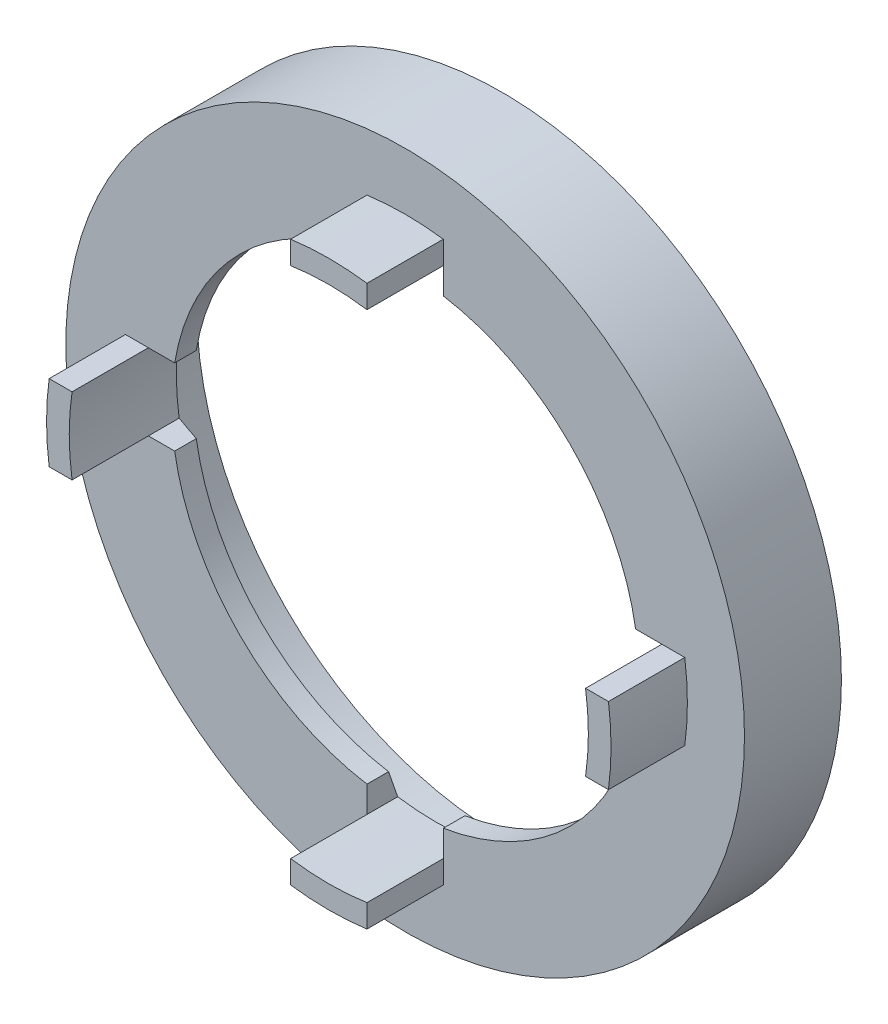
ISO-10303-21;
HEADER;
FILE_DESCRIPTION(('STEP AP214'),'2;1');
FILE_NAME('part.step','',(''),(''),'','','');
FILE_SCHEMA(('AUTOMOTIVE_DESIGN { 1 0 10303 214 1 1 1 1 }'));
ENDSEC;
DATA;
#1=APPLICATION_CONTEXT('core data for automotive mechanical design processes');
#2=APPLICATION_PROTOCOL_DEFINITION('international standard','automotive_design',2000,#1);
#3=PRODUCT_CONTEXT('',#1,'mechanical');
#4=PRODUCT('Part','Part','',(#3));
#5=PRODUCT_RELATED_PRODUCT_CATEGORY('part','',(#4));
#6=PRODUCT_DEFINITION_FORMATION('','',#4);
#7=PRODUCT_DEFINITION_CONTEXT('part definition',#1,'design');
#8=PRODUCT_DEFINITION('design','',#6,#7);
#9=PRODUCT_DEFINITION_SHAPE('','',#8);
#10=(LENGTH_UNIT() NAMED_UNIT(*) SI_UNIT(.MILLI.,.METRE.));
#11=(NAMED_UNIT(*) PLANE_ANGLE_UNIT() SI_UNIT($,.RADIAN.));
#12=(NAMED_UNIT(*) SI_UNIT($,.STERADIAN.) SOLID_ANGLE_UNIT());
#13=UNCERTAINTY_MEASURE_WITH_UNIT(LENGTH_MEASURE(1.E-05),#10,'distance_accuracy_value','');
#14=(GEOMETRIC_REPRESENTATION_CONTEXT(3) GLOBAL_UNCERTAINTY_ASSIGNED_CONTEXT((#13)) GLOBAL_UNIT_ASSIGNED_CONTEXT((#10,
#11,#12)) REPRESENTATION_CONTEXT('',''));
#15=CARTESIAN_POINT('',(0.,0.,0.));
#16=DIRECTION('',(0.,0.,1.));
#17=DIRECTION('',(1.,0.,0.));
#18=AXIS2_PLACEMENT_3D('',#15,#16,#17);
#19=CARTESIAN_POINT('',(0.,0.,-0.00100000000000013));
#20=DIRECTION('',(0.,0.,1.));
#21=DIRECTION('',(1.,0.,0.));
#22=AXIS2_PLACEMENT_3D('',#19,#20,#21);
#23=CYLINDRICAL_SURFACE('',#22,15.3);
#24=CARTESIAN_POINT('',(0.,0.,6.35));
#25=DIRECTION('',(0.,0.,1.));
#26=DIRECTION('',(1.,0.,0.));
#27=AXIS2_PLACEMENT_3D('',#24,#25,#26);
#28=CIRCLE('',#27,15.3);
#29=CARTESIAN_POINT('',(-15.0943698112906,-2.5,6.35));
#30=VERTEX_POINT('',#29);
#31=CARTESIAN_POINT('',(-2.50000000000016,-15.0943698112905,6.35));
#32=VERTEX_POINT('',#31);
#33=EDGE_CURVE('E458',#30,#32,#28,.T.);
#34=ORIENTED_EDGE('',*,*,#33,.T.);
#35=DIRECTION('',(0.,0.,1.));
#36=VECTOR('',#35,1.);
#37=CARTESIAN_POINT('',(-2.50000000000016,-15.0943698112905,0.));
#38=LINE('',#37,#36);
#39=CARTESIAN_POINT('',(-2.50000000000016,-15.0943698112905,4.93597347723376));
#40=VERTEX_POINT('',#39);
#41=EDGE_CURVE('E549',#40,#32,#38,.T.);
#42=ORIENTED_EDGE('',*,*,#41,.F.);
#43=CARTESIAN_POINT('',(0.,0.,4.93597347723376));
#44=DIRECTION('',(0.,0.,-1.));
#45=DIRECTION('',(-1.,0.,0.));
#46=AXIS2_PLACEMENT_3D('',#43,#44,#45);
#47=CIRCLE('',#46,15.3);
#48=CARTESIAN_POINT('',(-15.0943698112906,-2.5,4.93597347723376));
#49=VERTEX_POINT('',#48);
#50=EDGE_CURVE('E39',#49,#40,#47,.F.);
#51=ORIENTED_EDGE('',*,*,#50,.F.);
#52=DIRECTION('',(0.,0.,1.));
#53=VECTOR('',#52,1.);
#54=CARTESIAN_POINT('',(-15.0943698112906,-2.5,0.));
#55=LINE('',#54,#53);
#56=EDGE_CURVE('E337',#49,#30,#55,.T.);
#57=ORIENTED_EDGE('',*,*,#56,.T.);
#58=EDGE_LOOP('',(#34,#42,#51,#57));
#59=FACE_BOUND('',#58,.T.);
#60=ADVANCED_FACE('F35',(#59),#23,.F.);
#61=CARTESIAN_POINT('',(0.,0.,4.33860931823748));
#62=DIRECTION('',(0.,0.,-1.));
#63=DIRECTION('',(-1.,0.,0.));
#64=AXIS2_PLACEMENT_3D('',#61,#62,#63);
#65=CONICAL_SURFACE('',#64,17.,1.23288313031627);
#66=CARTESIAN_POINT('',(-2.50000000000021,-19.9102654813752,3.26103258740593));
#67=CARTESIAN_POINT('',(-2.5000000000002,-19.3470900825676,3.45738063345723));
#68=CARTESIAN_POINT('',(-2.50000000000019,-18.7838773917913,3.65362183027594));
#69=CARTESIAN_POINT('',(-2.50000000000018,-17.657347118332,4.04580190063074));
#70=CARTESIAN_POINT('',(-2.50000000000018,-17.0940295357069,4.24174077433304));
#71=CARTESIAN_POINT('',(-2.50000000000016,-15.9672583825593,4.63322784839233));
#72=CARTESIAN_POINT('',(-2.50000000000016,-15.4038048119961,4.82877604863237));
#73=CARTESIAN_POINT('',(-2.50000000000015,-14.276705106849,5.21931764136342));
#74=CARTESIAN_POINT('',(-2.50000000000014,-13.7130589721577,5.41431103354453));
#75=CARTESIAN_POINT('',(-2.50000000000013,-13.1492884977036,5.60894487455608));
#76=B_SPLINE_CURVE_WITH_KNOTS('',3,(#66,#67,#68,#69,#70,#71,#72,#73,#74,#75),.UNSPECIFIED.,.F.,
.F.,(4,2,2,2,4),(0.,1.78926574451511,3.57853050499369,5.36779580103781,7.15706209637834),.UNSPECIFIED.);
#77=CARTESIAN_POINT('',(-2.50000000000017,-16.8151717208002,4.33860931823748));
#78=VERTEX_POINT('',#77);
#79=EDGE_CURVE('E485',#78,#40,#76,.T.);
#80=ORIENTED_EDGE('',*,*,#79,.F.);
#81=CARTESIAN_POINT('',(0.,0.,4.33860931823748));
#82=DIRECTION('',(0.,0.,1.));
#83=DIRECTION('',(1.,0.,0.));
#84=AXIS2_PLACEMENT_3D('',#81,#82,#83);
#85=CIRCLE('',#84,17.);
#86=CARTESIAN_POINT('',(-16.8151717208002,-2.5,4.33860931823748));
#87=VERTEX_POINT('',#86);
#88=EDGE_CURVE('E607',#87,#78,#85,.T.);
#89=ORIENTED_EDGE('',*,*,#88,.F.);
#90=CARTESIAN_POINT('',(-13.1492884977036,-2.5,5.60894487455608));
#91=CARTESIAN_POINT('',(-13.7130589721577,-2.5,5.41431103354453));
#92=CARTESIAN_POINT('',(-14.276705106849,-2.5,5.21931764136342));
#93=CARTESIAN_POINT('',(-15.4038048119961,-2.5,4.82877604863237));
#94=CARTESIAN_POINT('',(-15.9672583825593,-2.5,4.63322784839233));
#95=CARTESIAN_POINT('',(-17.0940295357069,-2.5,4.24174077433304));
#96=CARTESIAN_POINT('',(-17.657347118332,-2.5,4.04580190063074));
#97=CARTESIAN_POINT('',(-18.7838773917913,-2.5,3.65362183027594));
#98=CARTESIAN_POINT('',(-19.3470900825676,-2.5,3.45738063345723));
#99=CARTESIAN_POINT('',(-19.9102654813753,-2.5,3.26103258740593));
#100=B_SPLINE_CURVE_WITH_KNOTS('',3,(#90,#91,#92,#93,#94,#95,#96,#97,#98,#99),.UNSPECIFIED.,.F.,
.F.,(4,2,2,2,4),(0.,1.78926629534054,3.57853159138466,5.36779635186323,7.15706209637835),.UNSPECIFIED.);
#101=EDGE_CURVE('E333',#49,#87,#100,.T.);
#102=ORIENTED_EDGE('',*,*,#101,.F.);
#103=ORIENTED_EDGE('',*,*,#50,.T.);
#104=EDGE_LOOP('',(#80,#89,#102,#103));
#105=FACE_BOUND('',#104,.T.);
#106=ADVANCED_FACE('F396',(#105),#65,.F.);
#107=CARTESIAN_POINT('',(2.49999999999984,-15.0943698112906,4.93597347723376));
#108=VERTEX_POINT('',#107);
#109=CARTESIAN_POINT('',(15.0943698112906,-2.5,4.93597347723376));
#110=VERTEX_POINT('',#109);
#111=EDGE_CURVE('E441',#108,#110,#47,.F.);
#112=ORIENTED_EDGE('',*,*,#111,.F.);
#113=DIRECTION('',(0.,0.,1.));
#114=VECTOR('',#113,1.);
#115=CARTESIAN_POINT('',(2.49999999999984,-15.0943698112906,0.));
#116=LINE('',#115,#114);
#117=CARTESIAN_POINT('',(2.49999999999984,-15.0943698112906,6.35));
#118=VERTEX_POINT('',#117);
#119=EDGE_CURVE('E235',#108,#118,#116,.T.);
#120=ORIENTED_EDGE('',*,*,#119,.T.);
#121=CARTESIAN_POINT('',(15.0943698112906,-2.5,6.35));
#122=VERTEX_POINT('',#121);
#123=EDGE_CURVE('E247',#118,#122,#28,.T.);
#124=ORIENTED_EDGE('',*,*,#123,.T.);
#125=DIRECTION('',(0.,0.,1.));
#126=VECTOR('',#125,1.);
#127=CARTESIAN_POINT('',(15.0943698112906,-2.5,0.));
#128=LINE('',#127,#126);
#129=EDGE_CURVE('E468',#110,#122,#128,.T.);
#130=ORIENTED_EDGE('',*,*,#129,.F.);
#131=EDGE_LOOP('',(#112,#120,#124,#130));
#132=FACE_BOUND('',#131,.T.);
#133=ADVANCED_FACE('F399',(#132),#23,.F.);
#134=CARTESIAN_POINT('',(2.49999999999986,-13.1492884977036,5.60894487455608));
#135=CARTESIAN_POINT('',(2.49999999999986,-13.7130589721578,5.41431103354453));
#136=CARTESIAN_POINT('',(2.49999999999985,-14.276705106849,5.21931764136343));
#137=CARTESIAN_POINT('',(2.49999999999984,-15.4038048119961,4.82877604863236));
#138=CARTESIAN_POINT('',(2.49999999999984,-15.9672583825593,4.63322784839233));
#139=CARTESIAN_POINT('',(2.49999999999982,-17.094029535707,4.24174077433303));
#140=CARTESIAN_POINT('',(2.49999999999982,-17.6573471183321,4.04580190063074));
#141=CARTESIAN_POINT('',(2.49999999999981,-18.7838773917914,3.65362183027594));
#142=CARTESIAN_POINT('',(2.4999999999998,-19.3470900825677,3.45738063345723));
#143=CARTESIAN_POINT('',(2.49999999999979,-19.9102654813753,3.26103258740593));
#144=B_SPLINE_CURVE_WITH_KNOTS('',3,(#134,#135,#136,#137,#138,#139,#140,#141,#142,#143),
.UNSPECIFIED.,.F.,.F.,(4,2,2,2,4),(0.,1.78926629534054,3.57853159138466,5.36779635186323,
7.15706209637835),.UNSPECIFIED.);
#145=CARTESIAN_POINT('',(2.49999999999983,-16.8151717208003,4.33860931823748));
#146=VERTEX_POINT('',#145);
#147=EDGE_CURVE('E231',#108,#146,#144,.T.);
#148=ORIENTED_EDGE('',*,*,#147,.F.);
#149=ORIENTED_EDGE('',*,*,#111,.T.);
#150=CARTESIAN_POINT('',(18.758943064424,-2.5,3.66225355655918));
#151=CARTESIAN_POINT('',(18.1957071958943,-2.5,3.85842851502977));
#152=CARTESIAN_POINT('',(17.632427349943,-2.5,4.05447738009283));
#153=CARTESIAN_POINT('',(16.505740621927,-2.5,4.44620814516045));
#154=CARTESIAN_POINT('',(15.9423337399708,-2.5,4.6418900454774));
#155=CARTESIAN_POINT('',(14.8153526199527,-2.5,5.03277253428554));
#156=CARTESIAN_POINT('',(14.2517783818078,-2.5,5.22797312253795));
#157=CARTESIAN_POINT('',(13.124386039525,-2.5,5.61767023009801));
#158=CARTESIAN_POINT('',(12.5605679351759,-2.5,5.81216674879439));
#159=CARTESIAN_POINT('',(11.9965899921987,-2.5,6.00619973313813));
#160=B_SPLINE_CURVE_WITH_KNOTS('',3,(#150,#151,#152,#153,#154,#155,#156,#157,#158,#159),
.UNSPECIFIED.,.F.,.F.,(4,2,2,2,4),(0.,1.7892661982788,3.57853087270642,5.36779643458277,
7.15706354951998),.UNSPECIFIED.);
#161=CARTESIAN_POINT('',(16.8151717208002,-2.5,4.33860931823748));
#162=VERTEX_POINT('',#161);
#163=EDGE_CURVE('E476',#162,#110,#160,.T.);
#164=ORIENTED_EDGE('',*,*,#163,.F.);
#165=EDGE_CURVE('E608',#146,#162,#85,.T.);
#166=ORIENTED_EDGE('',*,*,#165,.F.);
#167=EDGE_LOOP('',(#148,#149,#164,#166));
#168=FACE_BOUND('',#167,.T.);
#169=ADVANCED_FACE('F405',(#168),#65,.F.);
#170=CARTESIAN_POINT('',(15.0943698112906,2.5,4.93597347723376));
#171=VERTEX_POINT('',#170);
#172=CARTESIAN_POINT('',(2.50000000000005,15.0943698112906,4.93597347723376));
#173=VERTEX_POINT('',#172);
#174=EDGE_CURVE('E433',#171,#173,#47,.F.);
#175=ORIENTED_EDGE('',*,*,#174,.F.);
#176=DIRECTION('',(0.,0.,1.));
#177=VECTOR('',#176,1.);
#178=CARTESIAN_POINT('',(15.0943698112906,2.5,0.));
#179=LINE('',#178,#177);
#180=CARTESIAN_POINT('',(15.0943698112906,2.5,6.35));
#181=VERTEX_POINT('',#180);
#182=EDGE_CURVE('E434',#171,#181,#179,.T.);
#183=ORIENTED_EDGE('',*,*,#182,.T.);
#184=CARTESIAN_POINT('',(2.50000000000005,15.0943698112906,6.35));
#185=VERTEX_POINT('',#184);
#186=EDGE_CURVE('E456',#181,#185,#28,.T.);
#187=ORIENTED_EDGE('',*,*,#186,.T.);
#188=DIRECTION('',(0.,0.,1.));
#189=VECTOR('',#188,1.);
#190=CARTESIAN_POINT('',(2.50000000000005,15.0943698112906,0.));
#191=LINE('',#190,#189);
#192=EDGE_CURVE('E437',#173,#185,#191,.T.);
#193=ORIENTED_EDGE('',*,*,#192,.F.);
#194=EDGE_LOOP('',(#175,#183,#187,#193));
#195=FACE_BOUND('',#194,.T.);
#196=ADVANCED_FACE('F410',(#195),#23,.F.);
#197=CARTESIAN_POINT('',(11.9965899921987,2.5,6.00619973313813));
#198=CARTESIAN_POINT('',(12.5605679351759,2.5,5.81216674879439));
#199=CARTESIAN_POINT('',(13.124386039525,2.5,5.61767023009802));
#200=CARTESIAN_POINT('',(14.2517783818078,2.5,5.22797312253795));
#201=CARTESIAN_POINT('',(14.8153526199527,2.5,5.03277253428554));
#202=CARTESIAN_POINT('',(15.9423337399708,2.5,4.6418900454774));
#203=CARTESIAN_POINT('',(16.505740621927,2.5,4.44620814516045));
#204=CARTESIAN_POINT('',(17.632427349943,2.5,4.05447738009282));
#205=CARTESIAN_POINT('',(18.1957071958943,2.5,3.85842851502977));
#206=CARTESIAN_POINT('',(18.758943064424,2.5,3.66225355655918));
#207=B_SPLINE_CURVE_WITH_KNOTS('',3,(#197,#198,#199,#200,#201,#202,#203,#204,#205,#206),
.UNSPECIFIED.,.F.,.F.,(4,2,2,2,4),(0.,1.78926711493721,3.57853267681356,5.36779735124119,
7.15706354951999),.UNSPECIFIED.);
#208=CARTESIAN_POINT('',(16.8151717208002,2.5,4.33860931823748));
#209=VERTEX_POINT('',#208);
#210=EDGE_CURVE('E489',#171,#209,#207,.T.);
#211=ORIENTED_EDGE('',*,*,#210,.F.);
#212=ORIENTED_EDGE('',*,*,#174,.T.);
#213=CARTESIAN_POINT('',(2.50000000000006,18.758943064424,3.66225355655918));
#214=CARTESIAN_POINT('',(2.50000000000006,18.1957071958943,3.85842851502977));
#215=CARTESIAN_POINT('',(2.50000000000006,17.632427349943,4.05447738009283));
#216=CARTESIAN_POINT('',(2.50000000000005,16.505740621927,4.44620814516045));
#217=CARTESIAN_POINT('',(2.50000000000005,15.9423337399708,4.6418900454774));
#218=CARTESIAN_POINT('',(2.50000000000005,14.8153526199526,5.03277253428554));
#219=CARTESIAN_POINT('',(2.50000000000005,14.2517783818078,5.22797312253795));
#220=CARTESIAN_POINT('',(2.50000000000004,13.124386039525,5.61767023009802));
#221=CARTESIAN_POINT('',(2.50000000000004,12.5605679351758,5.81216674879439));
#222=CARTESIAN_POINT('',(2.50000000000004,11.9965899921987,6.00619973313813));
#223=B_SPLINE_CURVE_WITH_KNOTS('',3,(#213,#214,#215,#216,#217,#218,#219,#220,#221,#222),
.UNSPECIFIED.,.F.,.F.,(4,2,2,2,4),(0.,1.7892661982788,3.57853087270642,5.36779643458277,
7.15706354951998),.UNSPECIFIED.);
#224=CARTESIAN_POINT('',(2.50000000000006,16.8151717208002,4.33860931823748));
#225=VERTEX_POINT('',#224);
#226=EDGE_CURVE('E520',#225,#173,#223,.T.);
#227=ORIENTED_EDGE('',*,*,#226,.F.);
#228=EDGE_CURVE('E613',#209,#225,#85,.T.);
#229=ORIENTED_EDGE('',*,*,#228,.F.);
#230=EDGE_LOOP('',(#211,#212,#227,#229));
#231=FACE_BOUND('',#230,.T.);
#232=ADVANCED_FACE('F422',(#231),#65,.F.);
#233=CARTESIAN_POINT('',(0.,0.,6.35));
#234=DIRECTION('',(0.,0.,1.));
#235=DIRECTION('',(1.,0.,0.));
#236=AXIS2_PLACEMENT_3D('',#233,#234,#235);
#237=PLANE('',#236);
#238=DIRECTION('',(0.,-1.,0.));
#239=VECTOR('',#238,1.);
#240=CARTESIAN_POINT('',(-2.50000000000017,-16.8151717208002,6.35));
#241=LINE('',#240,#239);
#242=CARTESIAN_POINT('',(-2.50000000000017,-16.8151717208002,6.35));
#243=VERTEX_POINT('',#242);
#244=EDGE_CURVE('E236',#32,#243,#241,.T.);
#245=ORIENTED_EDGE('',*,*,#244,.F.);
#246=ORIENTED_EDGE('',*,*,#33,.F.);
#247=DIRECTION('',(1.,0.,0.));
#248=VECTOR('',#247,1.);
#249=CARTESIAN_POINT('',(-16.8151717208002,-2.5,6.35));
#250=LINE('',#249,#248);
#251=CARTESIAN_POINT('',(-16.8151717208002,-2.5,6.35));
#252=VERTEX_POINT('',#251);
#253=EDGE_CURVE('E325',#252,#30,#250,.T.);
#254=ORIENTED_EDGE('',*,*,#253,.F.);
#255=DIRECTION('',(1.,0.,0.));
#256=VECTOR('',#255,1.);
#257=CARTESIAN_POINT('',(-18.3151717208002,-2.5,6.35));
#258=LINE('',#257,#256);
#259=CARTESIAN_POINT('',(-18.3151717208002,-2.5,6.35));
#260=VERTEX_POINT('',#259);
#261=EDGE_CURVE('E574',#260,#252,#258,.T.);
#262=ORIENTED_EDGE('',*,*,#261,.F.);
#263=CARTESIAN_POINT('',(0.,0.,6.35));
#264=DIRECTION('',(0.,0.,1.));
#265=DIRECTION('',(1.,0.,0.));
#266=AXIS2_PLACEMENT_3D('',#263,#264,#265);
#267=CIRCLE('',#266,18.4850078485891);
#268=CARTESIAN_POINT('',(-18.3151717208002,2.5,6.35));
#269=VERTEX_POINT('',#268);
#270=EDGE_CURVE('E584',#269,#260,#267,.T.);
#271=ORIENTED_EDGE('',*,*,#270,.F.);
#272=DIRECTION('',(-1.,0.,0.));
#273=VECTOR('',#272,1.);
#274=CARTESIAN_POINT('',(-16.8151717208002,2.5,6.35));
#275=LINE('',#274,#273);
#276=CARTESIAN_POINT('',(-16.8151717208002,2.5,6.35));
#277=VERTEX_POINT('',#276);
#278=EDGE_CURVE('E648',#277,#269,#275,.T.);
#279=ORIENTED_EDGE('',*,*,#278,.F.);
#280=DIRECTION('',(-1.,0.,0.));
#281=VECTOR('',#280,1.);
#282=CARTESIAN_POINT('',(-16.8151717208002,2.5,6.35));
#283=LINE('',#282,#281);
#284=CARTESIAN_POINT('',(-15.0943698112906,2.5,6.35));
#285=VERTEX_POINT('',#284);
#286=EDGE_CURVE('E327',#285,#277,#283,.T.);
#287=ORIENTED_EDGE('',*,*,#286,.F.);
#288=CARTESIAN_POINT('',(-2.49999999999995,15.0943698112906,6.35));
#289=VERTEX_POINT('',#288);
#290=EDGE_CURVE('E452',#289,#285,#28,.T.);
#291=ORIENTED_EDGE('',*,*,#290,.F.);
#292=DIRECTION('',(0.,-1.,0.));
#293=VECTOR('',#292,1.);
#294=CARTESIAN_POINT('',(-2.49999999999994,16.8151717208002,6.35));
#295=LINE('',#294,#293);
#296=CARTESIAN_POINT('',(-2.49999999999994,16.8151717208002,6.35));
#297=VERTEX_POINT('',#296);
#298=EDGE_CURVE('E644',#297,#289,#295,.T.);
#299=ORIENTED_EDGE('',*,*,#298,.F.);
#300=DIRECTION('',(0.,-1.,0.));
#301=VECTOR('',#300,1.);
#302=CARTESIAN_POINT('',(-2.49999999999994,18.3151717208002,6.35));
#303=LINE('',#302,#301);
#304=CARTESIAN_POINT('',(-2.49999999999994,18.3151717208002,6.35));
#305=VERTEX_POINT('',#304);
#306=EDGE_CURVE('E302',#305,#297,#303,.T.);
#307=ORIENTED_EDGE('',*,*,#306,.F.);
#308=CARTESIAN_POINT('',(0.,0.,6.35));
#309=DIRECTION('',(0.,0.,1.));
#310=DIRECTION('',(0.,-1.,0.));
#311=AXIS2_PLACEMENT_3D('',#308,#309,#310);
#312=CIRCLE('',#311,18.4850078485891);
#313=CARTESIAN_POINT('',(2.50000000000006,18.3151717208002,6.35));
#314=VERTEX_POINT('',#313);
#315=EDGE_CURVE('E310',#314,#305,#312,.T.);
#316=ORIENTED_EDGE('',*,*,#315,.F.);
#317=DIRECTION('',(0.,1.,0.));
#318=VECTOR('',#317,1.);
#319=CARTESIAN_POINT('',(2.50000000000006,16.8151717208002,6.35));
#320=LINE('',#319,#318);
#321=CARTESIAN_POINT('',(2.50000000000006,16.8151717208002,6.35));
#322=VERTEX_POINT('',#321);
#323=EDGE_CURVE('E297',#322,#314,#320,.T.);
#324=ORIENTED_EDGE('',*,*,#323,.F.);
#325=DIRECTION('',(0.,1.,0.));
#326=VECTOR('',#325,1.);
#327=CARTESIAN_POINT('',(2.50000000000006,16.8151717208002,6.35));
#328=LINE('',#327,#326);
#329=EDGE_CURVE('E626',#185,#322,#328,.T.);
#330=ORIENTED_EDGE('',*,*,#329,.F.);
#331=ORIENTED_EDGE('',*,*,#186,.F.);
#332=DIRECTION('',(-1.,0.,0.));
#333=VECTOR('',#332,1.);
#334=CARTESIAN_POINT('',(16.8151717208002,2.5,6.35));
#335=LINE('',#334,#333);
#336=CARTESIAN_POINT('',(16.8151717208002,2.5,6.35));
#337=VERTEX_POINT('',#336);
#338=EDGE_CURVE('E482',#337,#181,#335,.T.);
#339=ORIENTED_EDGE('',*,*,#338,.F.);
#340=DIRECTION('',(-1.,0.,0.));
#341=VECTOR('',#340,1.);
#342=CARTESIAN_POINT('',(18.3151717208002,2.5,6.35));
#343=LINE('',#342,#341);
#344=CARTESIAN_POINT('',(18.3151717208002,2.5,6.35));
#345=VERTEX_POINT('',#344);
#346=EDGE_CURVE('E277',#345,#337,#343,.T.);
#347=ORIENTED_EDGE('',*,*,#346,.F.);
#348=CARTESIAN_POINT('',(0.,0.,6.35));
#349=DIRECTION('',(0.,0.,1.));
#350=DIRECTION('',(-1.,0.,0.));
#351=AXIS2_PLACEMENT_3D('',#348,#349,#350);
#352=CIRCLE('',#351,18.4850078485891);
#353=CARTESIAN_POINT('',(18.3151717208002,-2.5,6.35));
#354=VERTEX_POINT('',#353);
#355=EDGE_CURVE('E285',#354,#345,#352,.T.);
#356=ORIENTED_EDGE('',*,*,#355,.F.);
#357=DIRECTION('',(1.,0.,0.));
#358=VECTOR('',#357,1.);
#359=CARTESIAN_POINT('',(16.8151717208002,-2.5,6.35));
#360=LINE('',#359,#358);
#361=CARTESIAN_POINT('',(16.8151717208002,-2.5,6.35));
#362=VERTEX_POINT('',#361);
#363=EDGE_CURVE('E272',#362,#354,#360,.T.);
#364=ORIENTED_EDGE('',*,*,#363,.F.);
#365=DIRECTION('',(1.,0.,0.));
#366=VECTOR('',#365,1.);
#367=CARTESIAN_POINT('',(16.8151717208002,-2.5,6.35));
#368=LINE('',#367,#366);
#369=EDGE_CURVE('E473',#122,#362,#368,.T.);
#370=ORIENTED_EDGE('',*,*,#369,.F.);
#371=ORIENTED_EDGE('',*,*,#123,.F.);
#372=DIRECTION('',(0.,1.,0.));
#373=VECTOR('',#372,1.);
#374=CARTESIAN_POINT('',(2.49999999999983,-16.8151717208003,6.35));
#375=LINE('',#374,#373);
#376=CARTESIAN_POINT('',(2.49999999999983,-16.8151717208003,6.35));
#377=VERTEX_POINT('',#376);
#378=EDGE_CURVE('E228',#377,#118,#375,.T.);
#379=ORIENTED_EDGE('',*,*,#378,.F.);
#380=DIRECTION('',(0.,1.,0.));
#381=VECTOR('',#380,1.);
#382=CARTESIAN_POINT('',(2.49999999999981,-18.3151717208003,6.35));
#383=LINE('',#382,#381);
#384=CARTESIAN_POINT('',(2.49999999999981,-18.3151717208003,6.35));
#385=VERTEX_POINT('',#384);
#386=EDGE_CURVE('E245',#385,#377,#383,.T.);
#387=ORIENTED_EDGE('',*,*,#386,.F.);
#388=CARTESIAN_POINT('',(0.,0.,6.35));
#389=DIRECTION('',(0.,0.,1.));
#390=DIRECTION('',(0.,1.,0.));
#391=AXIS2_PLACEMENT_3D('',#388,#389,#390);
#392=CIRCLE('',#391,18.4850078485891);
#393=CARTESIAN_POINT('',(-2.50000000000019,-18.3151717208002,6.35));
#394=VERTEX_POINT('',#393);
#395=EDGE_CURVE('E254',#394,#385,#392,.T.);
#396=ORIENTED_EDGE('',*,*,#395,.F.);
#397=DIRECTION('',(0.,-1.,0.));
#398=VECTOR('',#397,1.);
#399=CARTESIAN_POINT('',(-2.50000000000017,-16.8151717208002,6.35));
#400=LINE('',#399,#398);
#401=EDGE_CURVE('E526',#243,#394,#400,.T.);
#402=ORIENTED_EDGE('',*,*,#401,.F.);
#403=EDGE_LOOP('',(#245,#246,#254,#262,#271,#279,#287,#291,#299,#307,#316,#324,#330,#331,#339,
#347,#356,#364,#370,#371,#379,#387,#396,#402));
#404=FACE_BOUND('',#403,.T.);
#405=CARTESIAN_POINT('',(0.,0.,6.35));
#406=DIRECTION('',(0.,0.,1.));
#407=DIRECTION('',(1.,0.,0.));
#408=AXIS2_PLACEMENT_3D('',#405,#406,#407);
#409=CIRCLE('',#408,22.225);
#410=CARTESIAN_POINT('',(22.225,0.,6.35));
#411=VERTEX_POINT('',#410);
#412=EDGE_CURVE('E11',#411,#411,#409,.T.);
#413=ORIENTED_EDGE('',*,*,#412,.T.);
#414=EDGE_LOOP('',(#413));
#415=FACE_BOUND('',#414,.T.);
#416=ADVANCED_FACE('F242',(#404,#415),#237,.T.);
#417=CARTESIAN_POINT('',(0.,0.,0.));
#418=DIRECTION('',(0.,0.,1.));
#419=DIRECTION('',(1.,0.,0.));
#420=AXIS2_PLACEMENT_3D('',#417,#418,#419);
#421=PLANE('',#420);
#422=CARTESIAN_POINT('',(0.,0.,0.));
#423=DIRECTION('',(0.,0.,1.));
#424=DIRECTION('',(1.,0.,0.));
#425=AXIS2_PLACEMENT_3D('',#422,#423,#424);
#426=CIRCLE('',#425,22.225);
#427=CARTESIAN_POINT('',(22.225,0.,0.));
#428=VERTEX_POINT('',#427);
#429=EDGE_CURVE('E44',#428,#428,#426,.T.);
#430=ORIENTED_EDGE('',*,*,#429,.F.);
#431=EDGE_LOOP('',(#430));
#432=FACE_BOUND('',#431,.T.);
#433=CARTESIAN_POINT('',(0.,0.,0.));
#434=DIRECTION('',(0.,0.,1.));
#435=DIRECTION('',(1.,0.,0.));
#436=AXIS2_PLACEMENT_3D('',#433,#434,#435);
#437=CIRCLE('',#436,20.);
#438=CARTESIAN_POINT('',(20.,0.,0.));
#439=VERTEX_POINT('',#438);
#440=EDGE_CURVE('E443',#439,#439,#437,.T.);
#441=ORIENTED_EDGE('',*,*,#440,.T.);
#442=EDGE_LOOP('',(#441));
#443=FACE_BOUND('',#442,.T.);
#444=ADVANCED_FACE('F412',(#432,#443),#421,.F.);
#445=CARTESIAN_POINT('',(-2.49999999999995,15.0943698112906,4.93597347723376));
#446=VERTEX_POINT('',#445);
#447=CARTESIAN_POINT('',(-15.0943698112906,2.5,4.93597347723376));
#448=VERTEX_POINT('',#447);
#449=EDGE_CURVE('E442',#446,#448,#47,.F.);
#450=ORIENTED_EDGE('',*,*,#449,.F.);
#451=DIRECTION('',(0.,0.,1.));
#452=VECTOR('',#451,1.);
#453=CARTESIAN_POINT('',(-2.49999999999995,15.0943698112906,0.));
#454=LINE('',#453,#452);
#455=EDGE_CURVE('E638',#446,#289,#454,.T.);
#456=ORIENTED_EDGE('',*,*,#455,.T.);
#457=ORIENTED_EDGE('',*,*,#290,.T.);
#458=DIRECTION('',(0.,0.,1.));
#459=VECTOR('',#458,1.);
#460=CARTESIAN_POINT('',(-15.0943698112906,2.5,0.));
#461=LINE('',#460,#459);
#462=EDGE_CURVE('E334',#448,#285,#461,.T.);
#463=ORIENTED_EDGE('',*,*,#462,.F.);
#464=EDGE_LOOP('',(#450,#456,#457,#463));
#465=FACE_BOUND('',#464,.T.);
#466=ADVANCED_FACE('F400',(#465),#23,.F.);
#467=CARTESIAN_POINT('',(0.,0.,6.35));
#468=DIRECTION('',(0.,0.,-1.));
#469=DIRECTION('',(-1.,0.,0.));
#470=AXIS2_PLACEMENT_3D('',#467,#468,#469);
#471=CYLINDRICAL_SURFACE('',#470,22.225);
#472=ORIENTED_EDGE('',*,*,#412,.F.);
#473=EDGE_LOOP('',(#472));
#474=FACE_BOUND('',#473,.T.);
#475=ORIENTED_EDGE('',*,*,#429,.T.);
#476=EDGE_LOOP('',(#475));
#477=FACE_BOUND('',#476,.T.);
#478=ADVANCED_FACE('F37',(#474,#477),#471,.T.);
#479=CARTESIAN_POINT('',(-2.49999999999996,11.9965899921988,6.00619973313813));
#480=CARTESIAN_POINT('',(-2.49999999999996,12.5605679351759,5.81216674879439));
#481=CARTESIAN_POINT('',(-2.49999999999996,13.124386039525,5.61767023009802));
#482=CARTESIAN_POINT('',(-2.49999999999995,14.2517783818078,5.22797312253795));
#483=CARTESIAN_POINT('',(-2.49999999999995,14.8153526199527,5.03277253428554));
#484=CARTESIAN_POINT('',(-2.49999999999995,15.9423337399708,4.6418900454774));
#485=CARTESIAN_POINT('',(-2.49999999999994,16.505740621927,4.44620814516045));
#486=CARTESIAN_POINT('',(-2.49999999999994,17.632427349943,4.05447738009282));
#487=CARTESIAN_POINT('',(-2.49999999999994,18.1957071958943,3.85842851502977));
#488=CARTESIAN_POINT('',(-2.49999999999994,18.758943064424,3.66225355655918));
#489=B_SPLINE_CURVE_WITH_KNOTS('',3,(#479,#480,#481,#482,#483,#484,#485,#486,#487,#488),
.UNSPECIFIED.,.F.,.F.,(4,2,2,2,4),(0.,1.78926711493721,3.57853267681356,5.36779735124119,
7.15706354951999),.UNSPECIFIED.);
#490=CARTESIAN_POINT('',(-2.49999999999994,16.8151717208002,4.33860931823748));
#491=VERTEX_POINT('',#490);
#492=EDGE_CURVE('E527',#446,#491,#489,.T.);
#493=ORIENTED_EDGE('',*,*,#492,.F.);
#494=ORIENTED_EDGE('',*,*,#449,.T.);
#495=CARTESIAN_POINT('',(-19.9102654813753,2.5,3.26103258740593));
#496=CARTESIAN_POINT('',(-19.3470900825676,2.5,3.45738063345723));
#497=CARTESIAN_POINT('',(-18.7838773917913,2.5,3.65362183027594));
#498=CARTESIAN_POINT('',(-17.657347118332,2.5,4.04580190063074));
#499=CARTESIAN_POINT('',(-17.0940295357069,2.5,4.24174077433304));
#500=CARTESIAN_POINT('',(-15.9672583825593,2.5,4.63322784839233));
#501=CARTESIAN_POINT('',(-15.4038048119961,2.5,4.82877604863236));
#502=CARTESIAN_POINT('',(-14.276705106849,2.5,5.21931764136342));
#503=CARTESIAN_POINT('',(-13.7130589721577,2.5,5.41431103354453));
#504=CARTESIAN_POINT('',(-13.1492884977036,2.5,5.60894487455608));
#505=B_SPLINE_CURVE_WITH_KNOTS('',3,(#495,#496,#497,#498,#499,#500,#501,#502,#503,#504),
.UNSPECIFIED.,.F.,.F.,(4,2,2,2,4),(0.,1.78926574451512,3.57853050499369,5.36779580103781,
7.15706209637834),.UNSPECIFIED.);
#506=CARTESIAN_POINT('',(-16.8151717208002,2.5,4.33860931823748));
#507=VERTEX_POINT('',#506);
#508=EDGE_CURVE('E347',#507,#448,#505,.T.);
#509=ORIENTED_EDGE('',*,*,#508,.F.);
#510=EDGE_CURVE('E606',#491,#507,#85,.T.);
#511=ORIENTED_EDGE('',*,*,#510,.F.);
#512=EDGE_LOOP('',(#493,#494,#509,#511));
#513=FACE_BOUND('',#512,.T.);
#514=ADVANCED_FACE('F353',(#513),#65,.F.);
#515=CARTESIAN_POINT('',(0.,0.,-1.424421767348));
#516=DIRECTION('',(0.,0.,1.));
#517=DIRECTION('',(1.,0.,0.));
#518=AXIS2_PLACEMENT_3D('',#515,#516,#517);
#519=CYLINDRICAL_SURFACE('',#518,20.);
#520=CARTESIAN_POINT('',(0.,0.,4.33860931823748));
#521=DIRECTION('',(0.,0.,1.));
#522=DIRECTION('',(1.,0.,0.));
#523=AXIS2_PLACEMENT_3D('',#520,#521,#522);
#524=CIRCLE('',#523,20.);
#525=CARTESIAN_POINT('',(20.,0.,4.33860931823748));
#526=VERTEX_POINT('',#525);
#527=EDGE_CURVE('E603',#526,#526,#524,.T.);
#528=ORIENTED_EDGE('',*,*,#527,.T.);
#529=EDGE_LOOP('',(#528));
#530=FACE_BOUND('',#529,.T.);
#531=ORIENTED_EDGE('',*,*,#440,.F.);
#532=EDGE_LOOP('',(#531));
#533=FACE_BOUND('',#532,.T.);
#534=ADVANCED_FACE('F387',(#530,#533),#519,.F.);
#535=CARTESIAN_POINT('',(-17.,0.,4.33860931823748));
#536=DIRECTION('',(0.,0.,-1.));
#537=DIRECTION('',(-1.,0.,0.));
#538=AXIS2_PLACEMENT_3D('',#535,#536,#537);
#539=PLANE('',#538);
#540=EDGE_CURVE('E449',#507,#87,#85,.T.);
#541=ORIENTED_EDGE('',*,*,#540,.T.);
#542=ORIENTED_EDGE('',*,*,#88,.T.);
#543=EDGE_CURVE('E547',#78,#146,#85,.T.);
#544=ORIENTED_EDGE('',*,*,#543,.T.);
#545=ORIENTED_EDGE('',*,*,#165,.T.);
#546=EDGE_CURVE('E610',#162,#209,#85,.T.);
#547=ORIENTED_EDGE('',*,*,#546,.T.);
#548=ORIENTED_EDGE('',*,*,#228,.T.);
#549=EDGE_CURVE('E609',#225,#491,#85,.T.);
#550=ORIENTED_EDGE('',*,*,#549,.T.);
#551=ORIENTED_EDGE('',*,*,#510,.T.);
#552=EDGE_LOOP('',(#541,#542,#544,#545,#547,#548,#550,#551));
#553=FACE_BOUND('',#552,.T.);
#554=ORIENTED_EDGE('',*,*,#527,.F.);
#555=EDGE_LOOP('',(#554));
#556=FACE_BOUND('',#555,.T.);
#557=ADVANCED_FACE('F384',(#553,#556),#539,.T.);
#558=CARTESIAN_POINT('',(0.,0.,11.35));
#559=DIRECTION('',(0.,0.,-1.));
#560=DIRECTION('',(-1.,0.,0.));
#561=AXIS2_PLACEMENT_3D('',#558,#559,#560);
#562=CYLINDRICAL_SURFACE('',#561,17.);
#563=DIRECTION('',(0.,0.,-1.));
#564=VECTOR('',#563,1.);
#565=CARTESIAN_POINT('',(-16.8151717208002,-2.5,11.35));
#566=LINE('',#565,#564);
#567=CARTESIAN_POINT('',(-16.8151717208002,-2.5,11.35));
#568=VERTEX_POINT('',#567);
#569=EDGE_CURVE('E578',#568,#252,#566,.T.);
#570=ORIENTED_EDGE('',*,*,#569,.T.);
#571=DIRECTION('',(0.,0.,1.));
#572=VECTOR('',#571,1.);
#573=CARTESIAN_POINT('',(-16.8151717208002,-2.5,0.));
#574=LINE('',#573,#572);
#575=EDGE_CURVE('E329',#87,#252,#574,.T.);
#576=ORIENTED_EDGE('',*,*,#575,.F.);
#577=ORIENTED_EDGE('',*,*,#540,.F.);
#578=DIRECTION('',(0.,0.,1.));
#579=VECTOR('',#578,1.);
#580=CARTESIAN_POINT('',(-16.8151717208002,2.5,0.));
#581=LINE('',#580,#579);
#582=EDGE_CURVE('E330',#507,#277,#581,.T.);
#583=ORIENTED_EDGE('',*,*,#582,.T.);
#584=DIRECTION('',(0.,0.,-1.));
#585=VECTOR('',#584,1.);
#586=CARTESIAN_POINT('',(-16.8151717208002,2.5,11.35));
#587=LINE('',#586,#585);
#588=CARTESIAN_POINT('',(-16.8151717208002,2.5,11.35));
#589=VERTEX_POINT('',#588);
#590=EDGE_CURVE('E600',#589,#277,#587,.T.);
#591=ORIENTED_EDGE('',*,*,#590,.F.);
#592=CARTESIAN_POINT('',(0.,0.,11.35));
#593=DIRECTION('',(0.,0.,-1.));
#594=DIRECTION('',(1.,0.,0.));
#595=AXIS2_PLACEMENT_3D('',#592,#593,#594);
#596=CIRCLE('',#595,17.);
#597=EDGE_CURVE('E583',#568,#589,#596,.T.);
#598=ORIENTED_EDGE('',*,*,#597,.F.);
#599=EDGE_LOOP('',(#570,#576,#577,#583,#591,#598));
#600=FACE_BOUND('',#599,.T.);
#601=ADVANCED_FACE('F381',(#600),#562,.F.);
#602=CARTESIAN_POINT('',(-16.8151717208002,2.5,11.35));
#603=DIRECTION('',(0.,-1.,0.));
#604=DIRECTION('',(1.,0.,0.));
#605=AXIS2_PLACEMENT_3D('',#602,#603,#604);
#606=PLANE('',#605);
#607=ORIENTED_EDGE('',*,*,#278,.T.);
#608=DIRECTION('',(0.,0.,-1.));
#609=VECTOR('',#608,1.);
#610=CARTESIAN_POINT('',(-18.3151717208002,2.5,11.35));
#611=LINE('',#610,#609);
#612=CARTESIAN_POINT('',(-18.3151717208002,2.5,11.35));
#613=VERTEX_POINT('',#612);
#614=EDGE_CURVE('E592',#613,#269,#611,.T.);
#615=ORIENTED_EDGE('',*,*,#614,.F.);
#616=DIRECTION('',(-1.,0.,0.));
#617=VECTOR('',#616,1.);
#618=CARTESIAN_POINT('',(-16.8151717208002,2.5,11.35));
#619=LINE('',#618,#617);
#620=EDGE_CURVE('E652',#589,#613,#619,.T.);
#621=ORIENTED_EDGE('',*,*,#620,.F.);
#622=ORIENTED_EDGE('',*,*,#590,.T.);
#623=EDGE_LOOP('',(#607,#615,#621,#622));
#624=FACE_BOUND('',#623,.T.);
#625=ADVANCED_FACE('F377',(#624),#606,.F.);
#626=CARTESIAN_POINT('',(0.,0.,11.35));
#627=DIRECTION('',(0.,0.,-1.));
#628=DIRECTION('',(-1.,0.,0.));
#629=AXIS2_PLACEMENT_3D('',#626,#627,#628);
#630=CYLINDRICAL_SURFACE('',#629,18.4850078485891);
#631=ORIENTED_EDGE('',*,*,#270,.T.);
#632=DIRECTION('',(0.,0.,-1.));
#633=VECTOR('',#632,1.);
#634=CARTESIAN_POINT('',(-18.3151717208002,-2.5,11.35));
#635=LINE('',#634,#633);
#636=CARTESIAN_POINT('',(-18.3151717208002,-2.5,11.35));
#637=VERTEX_POINT('',#636);
#638=EDGE_CURVE('E581',#637,#260,#635,.T.);
#639=ORIENTED_EDGE('',*,*,#638,.F.);
#640=CARTESIAN_POINT('',(0.,0.,11.35));
#641=DIRECTION('',(0.,0.,1.));
#642=DIRECTION('',(1.,0.,0.));
#643=AXIS2_PLACEMENT_3D('',#640,#641,#642);
#644=CIRCLE('',#643,18.4850078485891);
#645=EDGE_CURVE('E594',#613,#637,#644,.T.);
#646=ORIENTED_EDGE('',*,*,#645,.F.);
#647=ORIENTED_EDGE('',*,*,#614,.T.);
#648=EDGE_LOOP('',(#631,#639,#646,#647));
#649=FACE_BOUND('',#648,.T.);
#650=ADVANCED_FACE('F373',(#649),#630,.T.);
#651=CARTESIAN_POINT('',(-18.3151717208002,-2.5,11.35));
#652=DIRECTION('',(0.,1.,0.));
#653=DIRECTION('',(0.,0.,1.));
#654=AXIS2_PLACEMENT_3D('',#651,#652,#653);
#655=PLANE('',#654);
#656=ORIENTED_EDGE('',*,*,#261,.T.);
#657=ORIENTED_EDGE('',*,*,#569,.F.);
#658=DIRECTION('',(1.,0.,0.));
#659=VECTOR('',#658,1.);
#660=CARTESIAN_POINT('',(-18.3151717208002,-2.5,11.35));
#661=LINE('',#660,#659);
#662=EDGE_CURVE('E590',#637,#568,#661,.T.);
#663=ORIENTED_EDGE('',*,*,#662,.F.);
#664=ORIENTED_EDGE('',*,*,#638,.T.);
#665=EDGE_LOOP('',(#656,#657,#663,#664));
#666=FACE_BOUND('',#665,.T.);
#667=ADVANCED_FACE('F369',(#666),#655,.F.);
#668=CARTESIAN_POINT('',(0.,0.,11.35));
#669=DIRECTION('',(0.,0.,1.));
#670=DIRECTION('',(1.,0.,0.));
#671=AXIS2_PLACEMENT_3D('',#668,#669,#670);
#672=PLANE('',#671);
#673=ORIENTED_EDGE('',*,*,#597,.T.);
#674=ORIENTED_EDGE('',*,*,#620,.T.);
#675=ORIENTED_EDGE('',*,*,#645,.T.);
#676=ORIENTED_EDGE('',*,*,#662,.T.);
#677=EDGE_LOOP('',(#673,#674,#675,#676));
#678=FACE_BOUND('',#677,.T.);
#679=ADVANCED_FACE('F366',(#678),#672,.T.);
#680=CARTESIAN_POINT('',(-16.8151717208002,2.5,0.));
#681=DIRECTION('',(0.,1.,0.));
#682=DIRECTION('',(0.,0.,1.));
#683=AXIS2_PLACEMENT_3D('',#680,#681,#682);
#684=PLANE('',#683);
#685=ORIENTED_EDGE('',*,*,#508,.T.);
#686=ORIENTED_EDGE('',*,*,#462,.T.);
#687=ORIENTED_EDGE('',*,*,#286,.T.);
#688=ORIENTED_EDGE('',*,*,#582,.F.);
#689=EDGE_LOOP('',(#685,#686,#687,#688));
#690=FACE_BOUND('',#689,.T.);
#691=ADVANCED_FACE('F362',(#690),#684,.F.);
#692=CARTESIAN_POINT('',(-16.8151717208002,-2.5,0.));
#693=DIRECTION('',(0.,-1.,0.));
#694=DIRECTION('',(0.,0.,-1.));
#695=AXIS2_PLACEMENT_3D('',#692,#693,#694);
#696=PLANE('',#695);
#697=ORIENTED_EDGE('',*,*,#101,.T.);
#698=ORIENTED_EDGE('',*,*,#575,.T.);
#699=ORIENTED_EDGE('',*,*,#253,.T.);
#700=ORIENTED_EDGE('',*,*,#56,.F.);
#701=EDGE_LOOP('',(#697,#698,#699,#700));
#702=FACE_BOUND('',#701,.T.);
#703=ADVANCED_FACE('F357',(#702),#696,.F.);
#704=CARTESIAN_POINT('',(0.,0.,11.35));
#705=DIRECTION('',(0.,0.,-1.));
#706=DIRECTION('',(-1.,0.,0.));
#707=AXIS2_PLACEMENT_3D('',#704,#705,#706);
#708=CYLINDRICAL_SURFACE('',#707,17.);
#709=DIRECTION('',(0.,0.,-1.));
#710=VECTOR('',#709,1.);
#711=CARTESIAN_POINT('',(-2.49999999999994,16.8151717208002,11.35));
#712=LINE('',#711,#710);
#713=CARTESIAN_POINT('',(-2.49999999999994,16.8151717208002,11.35));
#714=VERTEX_POINT('',#713);
#715=EDGE_CURVE('E308',#714,#297,#712,.T.);
#716=ORIENTED_EDGE('',*,*,#715,.T.);
#717=DIRECTION('',(0.,0.,1.));
#718=VECTOR('',#717,1.);
#719=CARTESIAN_POINT('',(-2.49999999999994,16.8151717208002,0.));
#720=LINE('',#719,#718);
#721=EDGE_CURVE('E624',#491,#297,#720,.T.);
#722=ORIENTED_EDGE('',*,*,#721,.F.);
#723=ORIENTED_EDGE('',*,*,#549,.F.);
#724=DIRECTION('',(0.,0.,1.));
#725=VECTOR('',#724,1.);
#726=CARTESIAN_POINT('',(2.50000000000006,16.8151717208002,0.));
#727=LINE('',#726,#725);
#728=EDGE_CURVE('E623',#225,#322,#727,.T.);
#729=ORIENTED_EDGE('',*,*,#728,.T.);
#730=DIRECTION('',(0.,0.,-1.));
#731=VECTOR('',#730,1.);
#732=CARTESIAN_POINT('',(2.50000000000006,16.8151717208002,11.35));
#733=LINE('',#732,#731);
#734=CARTESIAN_POINT('',(2.50000000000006,16.8151717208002,11.35));
#735=VERTEX_POINT('',#734);
#736=EDGE_CURVE('E322',#735,#322,#733,.T.);
#737=ORIENTED_EDGE('',*,*,#736,.F.);
#738=CARTESIAN_POINT('',(0.,0.,11.35));
#739=DIRECTION('',(0.,0.,-1.));
#740=DIRECTION('',(0.,-1.,0.));
#741=AXIS2_PLACEMENT_3D('',#738,#739,#740);
#742=CIRCLE('',#741,17.);
#743=EDGE_CURVE('E298',#714,#735,#742,.T.);
#744=ORIENTED_EDGE('',*,*,#743,.F.);
#745=EDGE_LOOP('',(#716,#722,#723,#729,#737,#744));
#746=FACE_BOUND('',#745,.T.);
#747=ADVANCED_FACE('F361',(#746),#708,.F.);
#748=CARTESIAN_POINT('',(2.50000000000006,16.8151717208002,11.35));
#749=DIRECTION('',(-1.,0.,0.));
#750=DIRECTION('',(0.,-1.,0.));
#751=AXIS2_PLACEMENT_3D('',#748,#749,#750);
#752=PLANE('',#751);
#753=ORIENTED_EDGE('',*,*,#323,.T.);
#754=DIRECTION('',(0.,0.,-1.));
#755=VECTOR('',#754,1.);
#756=CARTESIAN_POINT('',(2.50000000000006,18.3151717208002,11.35));
#757=LINE('',#756,#755);
#758=CARTESIAN_POINT('',(2.50000000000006,18.3151717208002,11.35));
#759=VERTEX_POINT('',#758);
#760=EDGE_CURVE('E319',#759,#314,#757,.T.);
#761=ORIENTED_EDGE('',*,*,#760,.F.);
#762=DIRECTION('',(0.,1.,0.));
#763=VECTOR('',#762,1.);
#764=CARTESIAN_POINT('',(2.50000000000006,16.8151717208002,11.35));
#765=LINE('',#764,#763);
#766=EDGE_CURVE('E301',#735,#759,#765,.T.);
#767=ORIENTED_EDGE('',*,*,#766,.F.);
#768=ORIENTED_EDGE('',*,*,#736,.T.);
#769=EDGE_LOOP('',(#753,#761,#767,#768));
#770=FACE_BOUND('',#769,.T.);
#771=ADVANCED_FACE('F777',(#770),#752,.F.);
#772=CARTESIAN_POINT('',(0.,0.,11.35));
#773=DIRECTION('',(0.,0.,-1.));
#774=DIRECTION('',(-1.,0.,0.));
#775=AXIS2_PLACEMENT_3D('',#772,#773,#774);
#776=CYLINDRICAL_SURFACE('',#775,18.4850078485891);
#777=ORIENTED_EDGE('',*,*,#315,.T.);
#778=DIRECTION('',(0.,0.,-1.));
#779=VECTOR('',#778,1.);
#780=CARTESIAN_POINT('',(-2.49999999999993,18.3151717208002,11.35));
#781=LINE('',#780,#779);
#782=CARTESIAN_POINT('',(-2.49999999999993,18.3151717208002,11.35));
#783=VERTEX_POINT('',#782);
#784=EDGE_CURVE('E317',#783,#305,#781,.T.);
#785=ORIENTED_EDGE('',*,*,#784,.F.);
#786=CARTESIAN_POINT('',(0.,0.,11.35));
#787=DIRECTION('',(0.,0.,1.));
#788=DIRECTION('',(0.,-1.,0.));
#789=AXIS2_PLACEMENT_3D('',#786,#787,#788);
#790=CIRCLE('',#789,18.4850078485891);
#791=EDGE_CURVE('E304',#759,#783,#790,.T.);
#792=ORIENTED_EDGE('',*,*,#791,.F.);
#793=ORIENTED_EDGE('',*,*,#760,.T.);
#794=EDGE_LOOP('',(#777,#785,#792,#793));
#795=FACE_BOUND('',#794,.T.);
#796=ADVANCED_FACE('F787',(#795),#776,.T.);
#797=CARTESIAN_POINT('',(-2.49999999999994,18.3151717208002,11.35));
#798=DIRECTION('',(1.,0.,0.));
#799=DIRECTION('',(0.,1.,0.));
#800=AXIS2_PLACEMENT_3D('',#797,#798,#799);
#801=PLANE('',#800);
#802=ORIENTED_EDGE('',*,*,#306,.T.);
#803=ORIENTED_EDGE('',*,*,#715,.F.);
#804=DIRECTION('',(0.,-1.,0.));
#805=VECTOR('',#804,1.);
#806=CARTESIAN_POINT('',(-2.49999999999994,18.3151717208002,11.35));
#807=LINE('',#806,#805);
#808=EDGE_CURVE('E306',#783,#714,#807,.T.);
#809=ORIENTED_EDGE('',*,*,#808,.F.);
#810=ORIENTED_EDGE('',*,*,#784,.T.);
#811=EDGE_LOOP('',(#802,#803,#809,#810));
#812=FACE_BOUND('',#811,.T.);
#813=ADVANCED_FACE('F796',(#812),#801,.F.);
#814=CARTESIAN_POINT('',(0.,0.,11.35));
#815=DIRECTION('',(0.,0.,1.));
#816=DIRECTION('',(0.,-1.,0.));
#817=AXIS2_PLACEMENT_3D('',#814,#815,#816);
#818=PLANE('',#817);
#819=ORIENTED_EDGE('',*,*,#743,.T.);
#820=ORIENTED_EDGE('',*,*,#766,.T.);
#821=ORIENTED_EDGE('',*,*,#791,.T.);
#822=ORIENTED_EDGE('',*,*,#808,.T.);
#823=EDGE_LOOP('',(#819,#820,#821,#822));
#824=FACE_BOUND('',#823,.T.);
#825=ADVANCED_FACE('F805',(#824),#818,.T.);
#826=CARTESIAN_POINT('',(0.,0.,11.35));
#827=DIRECTION('',(0.,0.,-1.));
#828=DIRECTION('',(-1.,0.,0.));
#829=AXIS2_PLACEMENT_3D('',#826,#827,#828);
#830=CYLINDRICAL_SURFACE('',#829,17.);
#831=DIRECTION('',(0.,0.,-1.));
#832=VECTOR('',#831,1.);
#833=CARTESIAN_POINT('',(16.8151717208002,2.5,11.35));
#834=LINE('',#833,#832);
#835=CARTESIAN_POINT('',(16.8151717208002,2.5,11.35));
#836=VERTEX_POINT('',#835);
#837=EDGE_CURVE('E283',#836,#337,#834,.T.);
#838=ORIENTED_EDGE('',*,*,#837,.T.);
#839=DIRECTION('',(0.,0.,1.));
#840=VECTOR('',#839,1.);
#841=CARTESIAN_POINT('',(16.8151717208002,2.5,0.));
#842=LINE('',#841,#840);
#843=EDGE_CURVE('E481',#209,#337,#842,.T.);
#844=ORIENTED_EDGE('',*,*,#843,.F.);
#845=ORIENTED_EDGE('',*,*,#546,.F.);
#846=DIRECTION('',(0.,0.,1.));
#847=VECTOR('',#846,1.);
#848=CARTESIAN_POINT('',(16.8151717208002,-2.5,0.));
#849=LINE('',#848,#847);
#850=EDGE_CURVE('E477',#162,#362,#849,.T.);
#851=ORIENTED_EDGE('',*,*,#850,.T.);
#852=DIRECTION('',(0.,0.,-1.));
#853=VECTOR('',#852,1.);
#854=CARTESIAN_POINT('',(16.8151717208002,-2.5,11.35));
#855=LINE('',#854,#853);
#856=CARTESIAN_POINT('',(16.8151717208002,-2.5,11.35));
#857=VERTEX_POINT('',#856);
#858=EDGE_CURVE('E294',#857,#362,#855,.T.);
#859=ORIENTED_EDGE('',*,*,#858,.F.);
#860=CARTESIAN_POINT('',(0.,0.,11.35));
#861=DIRECTION('',(0.,0.,-1.));
#862=DIRECTION('',(-1.,0.,0.));
#863=AXIS2_PLACEMENT_3D('',#860,#861,#862);
#864=CIRCLE('',#863,17.);
#865=EDGE_CURVE('E273',#836,#857,#864,.T.);
#866=ORIENTED_EDGE('',*,*,#865,.F.);
#867=EDGE_LOOP('',(#838,#844,#845,#851,#859,#866));
#868=FACE_BOUND('',#867,.T.);
#869=ADVANCED_FACE('F631',(#868),#830,.F.);
#870=CARTESIAN_POINT('',(16.8151717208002,-2.5,11.35));
#871=DIRECTION('',(0.,1.,0.));
#872=DIRECTION('',(-1.,0.,0.));
#873=AXIS2_PLACEMENT_3D('',#870,#871,#872);
#874=PLANE('',#873);
#875=ORIENTED_EDGE('',*,*,#363,.T.);
#876=DIRECTION('',(0.,0.,-1.));
#877=VECTOR('',#876,1.);
#878=CARTESIAN_POINT('',(18.3151717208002,-2.5,11.35));
#879=LINE('',#878,#877);
#880=CARTESIAN_POINT('',(18.3151717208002,-2.5,11.35));
#881=VERTEX_POINT('',#880);
#882=EDGE_CURVE('E291',#881,#354,#879,.T.);
#883=ORIENTED_EDGE('',*,*,#882,.F.);
#884=DIRECTION('',(1.,0.,0.));
#885=VECTOR('',#884,1.);
#886=CARTESIAN_POINT('',(16.8151717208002,-2.5,11.35));
#887=LINE('',#886,#885);
#888=EDGE_CURVE('E276',#857,#881,#887,.T.);
#889=ORIENTED_EDGE('',*,*,#888,.F.);
#890=ORIENTED_EDGE('',*,*,#858,.T.);
#891=EDGE_LOOP('',(#875,#883,#889,#890));
#892=FACE_BOUND('',#891,.T.);
#893=ADVANCED_FACE('F822',(#892),#874,.F.);
#894=CARTESIAN_POINT('',(0.,0.,11.35));
#895=DIRECTION('',(0.,0.,-1.));
#896=DIRECTION('',(-1.,0.,0.));
#897=AXIS2_PLACEMENT_3D('',#894,#895,#896);
#898=CYLINDRICAL_SURFACE('',#897,18.4850078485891);
#899=ORIENTED_EDGE('',*,*,#355,.T.);
#900=DIRECTION('',(0.,0.,-1.));
#901=VECTOR('',#900,1.);
#902=CARTESIAN_POINT('',(18.3151717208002,2.5,11.35));
#903=LINE('',#902,#901);
#904=CARTESIAN_POINT('',(18.3151717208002,2.5,11.35));
#905=VERTEX_POINT('',#904);
#906=EDGE_CURVE('E60',#905,#345,#903,.T.);
#907=ORIENTED_EDGE('',*,*,#906,.F.);
#908=CARTESIAN_POINT('',(0.,0.,11.35));
#909=DIRECTION('',(0.,0.,1.));
#910=DIRECTION('',(-1.,0.,0.));
#911=AXIS2_PLACEMENT_3D('',#908,#909,#910);
#912=CIRCLE('',#911,18.4850078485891);
#913=EDGE_CURVE('E279',#881,#905,#912,.T.);
#914=ORIENTED_EDGE('',*,*,#913,.F.);
#915=ORIENTED_EDGE('',*,*,#882,.T.);
#916=EDGE_LOOP('',(#899,#907,#914,#915));
#917=FACE_BOUND('',#916,.T.);
#918=ADVANCED_FACE('F832',(#917),#898,.T.);
#919=CARTESIAN_POINT('',(18.3151717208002,2.5,11.35));
#920=DIRECTION('',(0.,-1.,0.));
#921=DIRECTION('',(0.,0.,-1.));
#922=AXIS2_PLACEMENT_3D('',#919,#920,#921);
#923=PLANE('',#922);
#924=ORIENTED_EDGE('',*,*,#346,.T.);
#925=ORIENTED_EDGE('',*,*,#837,.F.);
#926=DIRECTION('',(-1.,0.,0.));
#927=VECTOR('',#926,1.);
#928=CARTESIAN_POINT('',(18.3151717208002,2.5,11.35));
#929=LINE('',#928,#927);
#930=EDGE_CURVE('E281',#905,#836,#929,.T.);
#931=ORIENTED_EDGE('',*,*,#930,.F.);
#932=ORIENTED_EDGE('',*,*,#906,.T.);
#933=EDGE_LOOP('',(#924,#925,#931,#932));
#934=FACE_BOUND('',#933,.T.);
#935=ADVANCED_FACE('F635',(#934),#923,.F.);
#936=CARTESIAN_POINT('',(0.,0.,11.35));
#937=DIRECTION('',(0.,0.,1.));
#938=DIRECTION('',(-1.,0.,0.));
#939=AXIS2_PLACEMENT_3D('',#936,#937,#938);
#940=PLANE('',#939);
#941=ORIENTED_EDGE('',*,*,#865,.T.);
#942=ORIENTED_EDGE('',*,*,#888,.T.);
#943=ORIENTED_EDGE('',*,*,#913,.T.);
#944=ORIENTED_EDGE('',*,*,#930,.T.);
#945=EDGE_LOOP('',(#941,#942,#943,#944));
#946=FACE_BOUND('',#945,.T.);
#947=ADVANCED_FACE('F849',(#946),#940,.T.);
#948=CARTESIAN_POINT('',(0.,0.,11.35));
#949=DIRECTION('',(0.,0.,-1.));
#950=DIRECTION('',(-1.,0.,0.));
#951=AXIS2_PLACEMENT_3D('',#948,#949,#950);
#952=CYLINDRICAL_SURFACE('',#951,17.);
#953=DIRECTION('',(0.,0.,-1.));
#954=VECTOR('',#953,1.);
#955=CARTESIAN_POINT('',(2.49999999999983,-16.8151717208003,11.35));
#956=LINE('',#955,#954);
#957=CARTESIAN_POINT('',(2.49999999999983,-16.8151717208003,11.35));
#958=VERTEX_POINT('',#957);
#959=EDGE_CURVE('E251',#958,#377,#956,.T.);
#960=ORIENTED_EDGE('',*,*,#959,.T.);
#961=DIRECTION('',(0.,0.,1.));
#962=VECTOR('',#961,1.);
#963=CARTESIAN_POINT('',(2.49999999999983,-16.8151717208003,0.));
#964=LINE('',#963,#962);
#965=EDGE_CURVE('E225',#146,#377,#964,.T.);
#966=ORIENTED_EDGE('',*,*,#965,.F.);
#967=ORIENTED_EDGE('',*,*,#543,.F.);
#968=DIRECTION('',(0.,0.,1.));
#969=VECTOR('',#968,1.);
#970=CARTESIAN_POINT('',(-2.50000000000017,-16.8151717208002,0.));
#971=LINE('',#970,#969);
#972=EDGE_CURVE('E545',#78,#243,#971,.T.);
#973=ORIENTED_EDGE('',*,*,#972,.T.);
#974=DIRECTION('',(0.,0.,-1.));
#975=VECTOR('',#974,1.);
#976=CARTESIAN_POINT('',(-2.50000000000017,-16.8151717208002,11.35));
#977=LINE('',#976,#975);
#978=CARTESIAN_POINT('',(-2.50000000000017,-16.8151717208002,11.35));
#979=VERTEX_POINT('',#978);
#980=EDGE_CURVE('E269',#979,#243,#977,.T.);
#981=ORIENTED_EDGE('',*,*,#980,.F.);
#982=CARTESIAN_POINT('',(0.,0.,11.35));
#983=DIRECTION('',(0.,0.,-1.));
#984=DIRECTION('',(0.,1.,0.));
#985=AXIS2_PLACEMENT_3D('',#982,#983,#984);
#986=CIRCLE('',#985,17.);
#987=EDGE_CURVE('E253',#958,#979,#986,.T.);
#988=ORIENTED_EDGE('',*,*,#987,.F.);
#989=EDGE_LOOP('',(#960,#966,#967,#973,#981,#988));
#990=FACE_BOUND('',#989,.T.);
#991=ADVANCED_FACE('F256',(#990),#952,.F.);
#992=CARTESIAN_POINT('',(-2.50000000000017,-16.8151717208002,11.35));
#993=DIRECTION('',(1.,0.,0.));
#994=DIRECTION('',(0.,1.,0.));
#995=AXIS2_PLACEMENT_3D('',#992,#993,#994);
#996=PLANE('',#995);
#997=ORIENTED_EDGE('',*,*,#401,.T.);
#998=DIRECTION('',(0.,0.,-1.));
#999=VECTOR('',#998,1.);
#1000=CARTESIAN_POINT('',(-2.50000000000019,-18.3151717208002,11.35));
#1001=LINE('',#1000,#999);
#1002=CARTESIAN_POINT('',(-2.50000000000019,-18.3151717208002,11.35));
#1003=VERTEX_POINT('',#1002);
#1004=EDGE_CURVE('E261',#1003,#394,#1001,.T.);
#1005=ORIENTED_EDGE('',*,*,#1004,.F.);
#1006=DIRECTION('',(0.,-1.,0.));
#1007=VECTOR('',#1006,1.);
#1008=CARTESIAN_POINT('',(-2.50000000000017,-16.8151717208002,11.35));
#1009=LINE('',#1008,#1007);
#1010=EDGE_CURVE('E533',#979,#1003,#1009,.T.);
#1011=ORIENTED_EDGE('',*,*,#1010,.F.);
#1012=ORIENTED_EDGE('',*,*,#980,.T.);
#1013=EDGE_LOOP('',(#997,#1005,#1011,#1012));
#1014=FACE_BOUND('',#1013,.T.);
#1015=ADVANCED_FACE('F542',(#1014),#996,.F.);
#1016=CARTESIAN_POINT('',(0.,0.,11.35));
#1017=DIRECTION('',(0.,0.,-1.));
#1018=DIRECTION('',(-1.,0.,0.));
#1019=AXIS2_PLACEMENT_3D('',#1016,#1017,#1018);
#1020=CYLINDRICAL_SURFACE('',#1019,18.4850078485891);
#1021=ORIENTED_EDGE('',*,*,#395,.T.);
#1022=DIRECTION('',(0.,0.,-1.));
#1023=VECTOR('',#1022,1.);
#1024=CARTESIAN_POINT('',(2.4999999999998,-18.3151717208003,11.35));
#1025=LINE('',#1024,#1023);
#1026=CARTESIAN_POINT('',(2.4999999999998,-18.3151717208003,11.35));
#1027=VERTEX_POINT('',#1026);
#1028=EDGE_CURVE('E52',#1027,#385,#1025,.T.);
#1029=ORIENTED_EDGE('',*,*,#1028,.F.);
#1030=CARTESIAN_POINT('',(0.,0.,11.35));
#1031=DIRECTION('',(0.,0.,1.));
#1032=DIRECTION('',(0.,1.,0.));
#1033=AXIS2_PLACEMENT_3D('',#1030,#1031,#1032);
#1034=CIRCLE('',#1033,18.4850078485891);
#1035=EDGE_CURVE('E263',#1003,#1027,#1034,.T.);
#1036=ORIENTED_EDGE('',*,*,#1035,.F.);
#1037=ORIENTED_EDGE('',*,*,#1004,.T.);
#1038=EDGE_LOOP('',(#1021,#1029,#1036,#1037));
#1039=FACE_BOUND('',#1038,.T.);
#1040=ADVANCED_FACE('F537',(#1039),#1020,.T.);
#1041=CARTESIAN_POINT('',(2.49999999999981,-18.3151717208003,11.35));
#1042=DIRECTION('',(-1.,0.,0.));
#1043=DIRECTION('',(0.,-1.,0.));
#1044=AXIS2_PLACEMENT_3D('',#1041,#1042,#1043);
#1045=PLANE('',#1044);
#1046=ORIENTED_EDGE('',*,*,#386,.T.);
#1047=ORIENTED_EDGE('',*,*,#959,.F.);
#1048=DIRECTION('',(0.,1.,0.));
#1049=VECTOR('',#1048,1.);
#1050=CARTESIAN_POINT('',(2.49999999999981,-18.3151717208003,11.35));
#1051=LINE('',#1050,#1049);
#1052=EDGE_CURVE('E259',#1027,#958,#1051,.T.);
#1053=ORIENTED_EDGE('',*,*,#1052,.F.);
#1054=ORIENTED_EDGE('',*,*,#1028,.T.);
#1055=EDGE_LOOP('',(#1046,#1047,#1053,#1054));
#1056=FACE_BOUND('',#1055,.T.);
#1057=ADVANCED_FACE('F250',(#1056),#1045,.F.);
#1058=CARTESIAN_POINT('',(0.,0.,11.35));
#1059=DIRECTION('',(0.,0.,1.));
#1060=DIRECTION('',(0.,1.,0.));
#1061=AXIS2_PLACEMENT_3D('',#1058,#1059,#1060);
#1062=PLANE('',#1061);
#1063=ORIENTED_EDGE('',*,*,#987,.T.);
#1064=ORIENTED_EDGE('',*,*,#1010,.T.);
#1065=ORIENTED_EDGE('',*,*,#1035,.T.);
#1066=ORIENTED_EDGE('',*,*,#1052,.T.);
#1067=EDGE_LOOP('',(#1063,#1064,#1065,#1066));
#1068=FACE_BOUND('',#1067,.T.);
#1069=ADVANCED_FACE('F515',(#1068),#1062,.T.);
#1070=CARTESIAN_POINT('',(2.50000000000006,16.8151717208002,0.));
#1071=DIRECTION('',(1.,0.,0.));
#1072=DIRECTION('',(0.,1.,0.));
#1073=AXIS2_PLACEMENT_3D('',#1070,#1071,#1072);
#1074=PLANE('',#1073);
#1075=ORIENTED_EDGE('',*,*,#226,.T.);
#1076=ORIENTED_EDGE('',*,*,#192,.T.);
#1077=ORIENTED_EDGE('',*,*,#329,.T.);
#1078=ORIENTED_EDGE('',*,*,#728,.F.);
#1079=EDGE_LOOP('',(#1075,#1076,#1077,#1078));
#1080=FACE_BOUND('',#1079,.T.);
#1081=ADVANCED_FACE('F510',(#1080),#1074,.F.);
#1082=CARTESIAN_POINT('',(-2.49999999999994,16.8151717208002,0.));
#1083=DIRECTION('',(-1.,0.,0.));
#1084=DIRECTION('',(0.,-1.,0.));
#1085=AXIS2_PLACEMENT_3D('',#1082,#1083,#1084);
#1086=PLANE('',#1085);
#1087=ORIENTED_EDGE('',*,*,#492,.T.);
#1088=ORIENTED_EDGE('',*,*,#721,.T.);
#1089=ORIENTED_EDGE('',*,*,#298,.T.);
#1090=ORIENTED_EDGE('',*,*,#455,.F.);
#1091=EDGE_LOOP('',(#1087,#1088,#1089,#1090));
#1092=FACE_BOUND('',#1091,.T.);
#1093=ADVANCED_FACE('F514',(#1092),#1086,.F.);
#1094=CARTESIAN_POINT('',(16.8151717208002,-2.5,0.));
#1095=DIRECTION('',(0.,-1.,0.));
#1096=DIRECTION('',(0.,0.,-1.));
#1097=AXIS2_PLACEMENT_3D('',#1094,#1095,#1096);
#1098=PLANE('',#1097);
#1099=ORIENTED_EDGE('',*,*,#163,.T.);
#1100=ORIENTED_EDGE('',*,*,#129,.T.);
#1101=ORIENTED_EDGE('',*,*,#369,.T.);
#1102=ORIENTED_EDGE('',*,*,#850,.F.);
#1103=EDGE_LOOP('',(#1099,#1100,#1101,#1102));
#1104=FACE_BOUND('',#1103,.T.);
#1105=ADVANCED_FACE('F471',(#1104),#1098,.F.);
#1106=CARTESIAN_POINT('',(16.8151717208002,2.5,0.));
#1107=DIRECTION('',(0.,1.,0.));
#1108=DIRECTION('',(0.,0.,1.));
#1109=AXIS2_PLACEMENT_3D('',#1106,#1107,#1108);
#1110=PLANE('',#1109);
#1111=ORIENTED_EDGE('',*,*,#210,.T.);
#1112=ORIENTED_EDGE('',*,*,#843,.T.);
#1113=ORIENTED_EDGE('',*,*,#338,.T.);
#1114=ORIENTED_EDGE('',*,*,#182,.F.);
#1115=EDGE_LOOP('',(#1111,#1112,#1113,#1114));
#1116=FACE_BOUND('',#1115,.T.);
#1117=ADVANCED_FACE('F502',(#1116),#1110,.F.);
#1118=CARTESIAN_POINT('',(-2.50000000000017,-16.8151717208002,0.));
#1119=DIRECTION('',(-1.,0.,0.));
#1120=DIRECTION('',(0.,-1.,0.));
#1121=AXIS2_PLACEMENT_3D('',#1118,#1119,#1120);
#1122=PLANE('',#1121);
#1123=ORIENTED_EDGE('',*,*,#79,.T.);
#1124=ORIENTED_EDGE('',*,*,#41,.T.);
#1125=ORIENTED_EDGE('',*,*,#244,.T.);
#1126=ORIENTED_EDGE('',*,*,#972,.F.);
#1127=EDGE_LOOP('',(#1123,#1124,#1125,#1126));
#1128=FACE_BOUND('',#1127,.T.);
#1129=ADVANCED_FACE('F506',(#1128),#1122,.F.);
#1130=CARTESIAN_POINT('',(2.49999999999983,-16.8151717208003,0.));
#1131=DIRECTION('',(1.,0.,0.));
#1132=DIRECTION('',(0.,1.,0.));
#1133=AXIS2_PLACEMENT_3D('',#1130,#1131,#1132);
#1134=PLANE('',#1133);
#1135=ORIENTED_EDGE('',*,*,#147,.T.);
#1136=ORIENTED_EDGE('',*,*,#965,.T.);
#1137=ORIENTED_EDGE('',*,*,#378,.T.);
#1138=ORIENTED_EDGE('',*,*,#119,.F.);
#1139=EDGE_LOOP('',(#1135,#1136,#1137,#1138));
#1140=FACE_BOUND('',#1139,.T.);
#1141=ADVANCED_FACE('F227',(#1140),#1134,.F.);
#1142=CLOSED_SHELL('',(#60,#106,#133,#169,#196,#232,#416,#444,#466,#478,#514,#534,#557,#601,
#625,#650,#667,#679,#691,#703,#747,#771,#796,#813,#825,#869,#893,#918,#935,#947,#991,#1015,
#1040,#1057,#1069,#1081,#1093,#1105,#1117,#1129,#1141));
#1143=MANIFOLD_SOLID_BREP('B2',#1142);
#1144=ADVANCED_BREP_SHAPE_REPRESENTATION('',(#18,#1143),#14);
#1145=SHAPE_DEFINITION_REPRESENTATION(#9,#1144);
ENDSEC;
END-ISO-10303-21;
